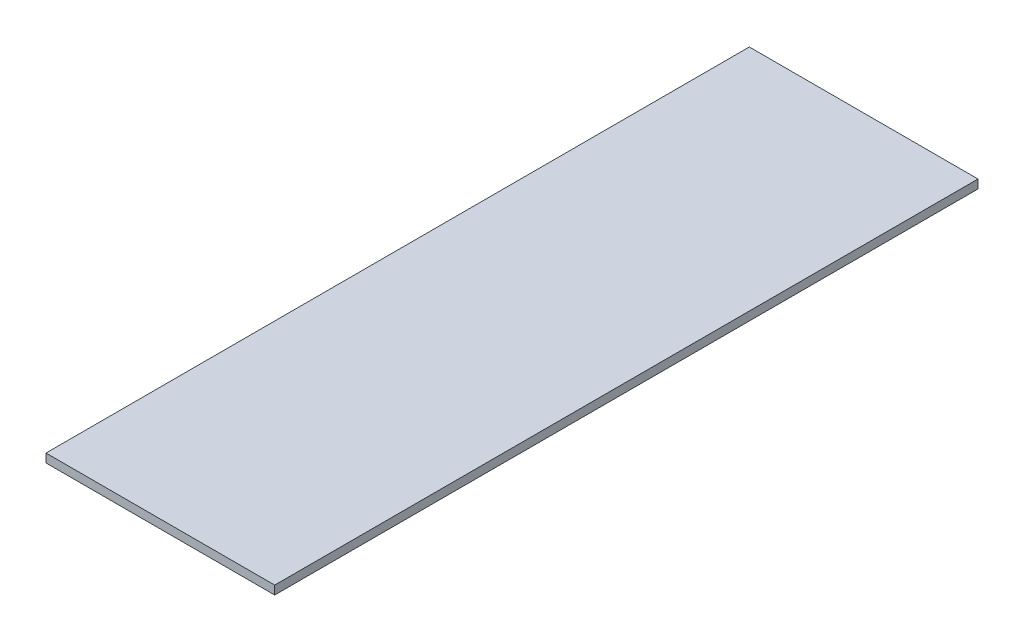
from build123d import *

# Parameters (mm, degrees)
SKETCH1_W           = 530
SKETCH1_H           = 20
BOSS_EXTRUDE1_DEPTH = 815


with BuildPart() as part:
    # Sketch1 → Boss-Extrude1 (new, symmetric)
    with BuildSketch(Plane.XY):
        Rectangle(SKETCH1_W, SKETCH1_H)
    extrude(amount=BOSS_EXTRUDE1_DEPTH, both=True)


solid = part.part
